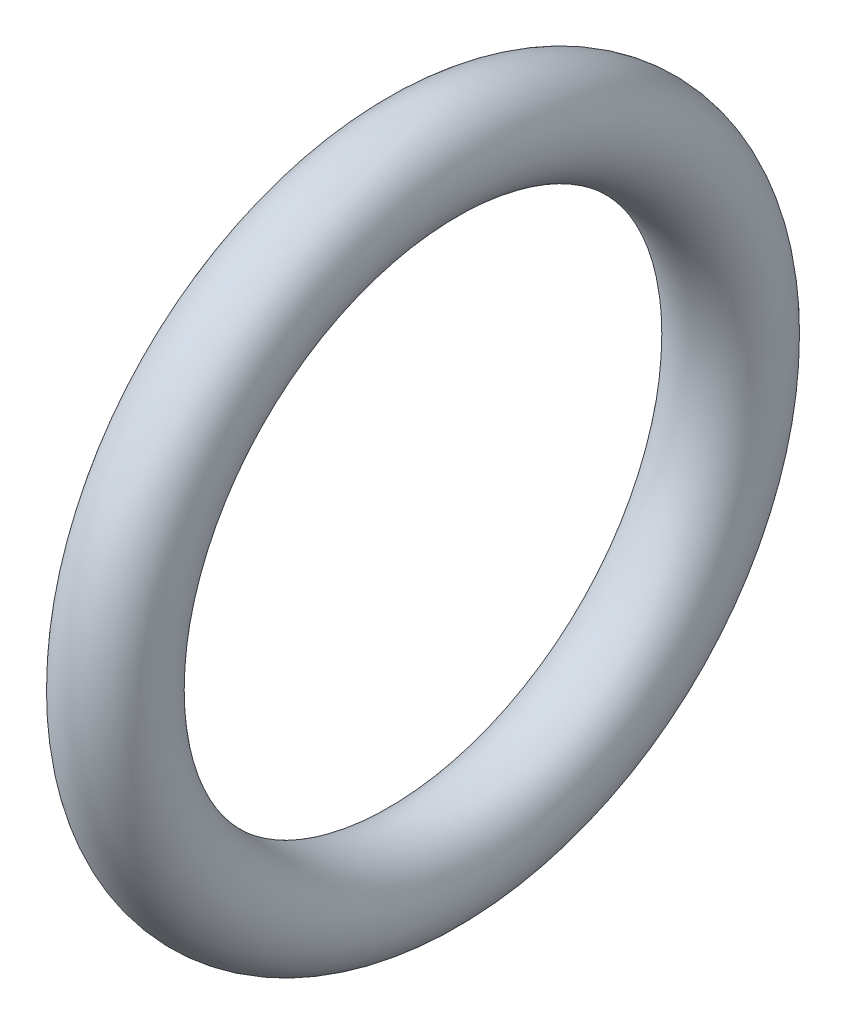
ISO-10303-21;
HEADER;
FILE_DESCRIPTION(('STEP AP214'),'2;1');
FILE_NAME('part.step','',(''),(''),'','','');
FILE_SCHEMA(('AUTOMOTIVE_DESIGN { 1 0 10303 214 1 1 1 1 }'));
ENDSEC;
DATA;
#1=APPLICATION_CONTEXT('core data for automotive mechanical design processes');
#2=APPLICATION_PROTOCOL_DEFINITION('international standard','automotive_design',2000,#1);
#3=PRODUCT_CONTEXT('',#1,'mechanical');
#4=PRODUCT('Part','Part','',(#3));
#5=PRODUCT_RELATED_PRODUCT_CATEGORY('part','',(#4));
#6=PRODUCT_DEFINITION_FORMATION('','',#4);
#7=PRODUCT_DEFINITION_CONTEXT('part definition',#1,'design');
#8=PRODUCT_DEFINITION('design','',#6,#7);
#9=PRODUCT_DEFINITION_SHAPE('','',#8);
#10=(LENGTH_UNIT() NAMED_UNIT(*) SI_UNIT(.MILLI.,.METRE.));
#11=(NAMED_UNIT(*) PLANE_ANGLE_UNIT() SI_UNIT($,.RADIAN.));
#12=(NAMED_UNIT(*) SI_UNIT($,.STERADIAN.) SOLID_ANGLE_UNIT());
#13=UNCERTAINTY_MEASURE_WITH_UNIT(LENGTH_MEASURE(1.E-05),#10,'distance_accuracy_value','');
#14=(GEOMETRIC_REPRESENTATION_CONTEXT(3) GLOBAL_UNCERTAINTY_ASSIGNED_CONTEXT((#13)) GLOBAL_UNIT_ASSIGNED_CONTEXT((#10,
#11,#12)) REPRESENTATION_CONTEXT('',''));
#15=CARTESIAN_POINT('',(0.,0.,0.));
#16=DIRECTION('',(0.,0.,1.));
#17=DIRECTION('',(1.,0.,0.));
#18=AXIS2_PLACEMENT_3D('',#15,#16,#17);
#19=CARTESIAN_POINT('',(0.,0.,0.));
#20=DIRECTION('',(-1.,0.,0.));
#21=DIRECTION('',(0.,0.,1.));
#22=AXIS2_PLACEMENT_3D('',#19,#20,#21);
#23=TOROIDAL_SURFACE('',#22,6.,0.950000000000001);
#24=CARTESIAN_POINT('',(0.,0.,6.95));
#25=VERTEX_POINT('',#24);
#26=VERTEX_LOOP('',#25);
#27=FACE_BOUND('',#26,.T.);
#28=ADVANCED_FACE('F43',(#27),#23,.T.);
#29=CLOSED_SHELL('',(#28));
#30=MANIFOLD_SOLID_BREP('B2',#29);
#31=ADVANCED_BREP_SHAPE_REPRESENTATION('',(#18,#30),#14);
#32=SHAPE_DEFINITION_REPRESENTATION(#9,#31);
ENDSEC;
END-ISO-10303-21;
